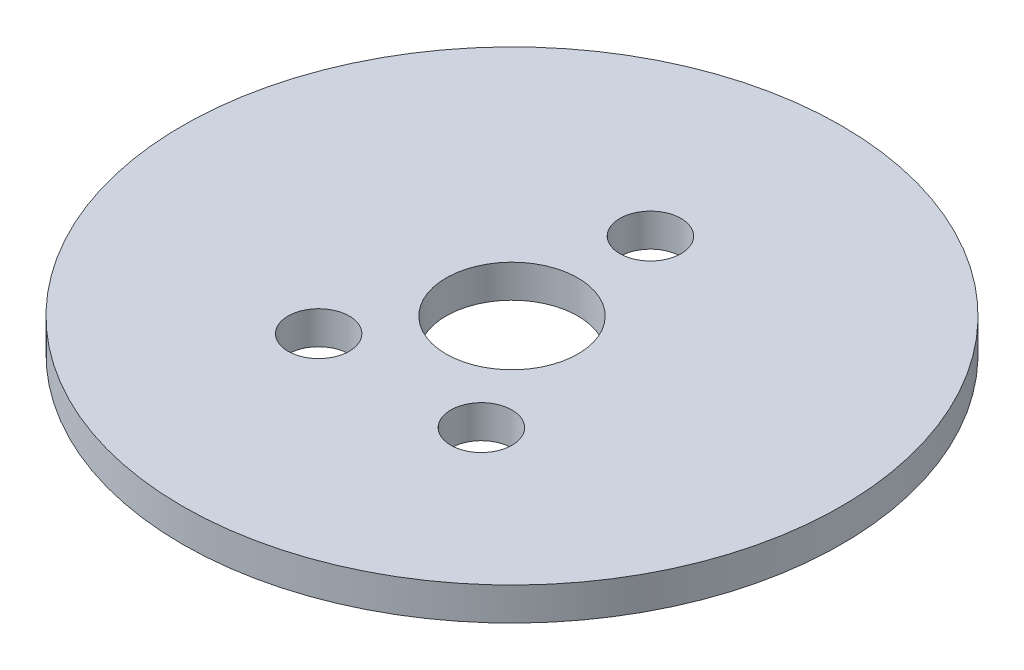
ISO-10303-21;
HEADER;
FILE_DESCRIPTION(('STEP AP214'),'2;1');
FILE_NAME('part.step','',(''),(''),'','','');
FILE_SCHEMA(('AUTOMOTIVE_DESIGN { 1 0 10303 214 1 1 1 1 }'));
ENDSEC;
DATA;
#1=APPLICATION_CONTEXT('core data for automotive mechanical design processes');
#2=APPLICATION_PROTOCOL_DEFINITION('international standard','automotive_design',2000,#1);
#3=PRODUCT_CONTEXT('',#1,'mechanical');
#4=PRODUCT('Part','Part','',(#3));
#5=PRODUCT_RELATED_PRODUCT_CATEGORY('part','',(#4));
#6=PRODUCT_DEFINITION_FORMATION('','',#4);
#7=PRODUCT_DEFINITION_CONTEXT('part definition',#1,'design');
#8=PRODUCT_DEFINITION('design','',#6,#7);
#9=PRODUCT_DEFINITION_SHAPE('','',#8);
#10=(LENGTH_UNIT() NAMED_UNIT(*) SI_UNIT(.MILLI.,.METRE.));
#11=(NAMED_UNIT(*) PLANE_ANGLE_UNIT() SI_UNIT($,.RADIAN.));
#12=(NAMED_UNIT(*) SI_UNIT($,.STERADIAN.) SOLID_ANGLE_UNIT());
#13=UNCERTAINTY_MEASURE_WITH_UNIT(LENGTH_MEASURE(1.E-05),#10,'distance_accuracy_value','');
#14=(GEOMETRIC_REPRESENTATION_CONTEXT(3) GLOBAL_UNCERTAINTY_ASSIGNED_CONTEXT((#13)) GLOBAL_UNIT_ASSIGNED_CONTEXT((#10,
#11,#12)) REPRESENTATION_CONTEXT('',''));
#15=CARTESIAN_POINT('',(0.,0.,0.));
#16=DIRECTION('',(0.,0.,1.));
#17=DIRECTION('',(1.,0.,0.));
#18=AXIS2_PLACEMENT_3D('',#15,#16,#17);
#19=CARTESIAN_POINT('',(0.562155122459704,1.5875,11.5195944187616));
#20=DIRECTION('',(0.,1.,0.));
#21=DIRECTION('',(0.,0.,1.));
#22=AXIS2_PLACEMENT_3D('',#19,#20,#21);
#23=PLANE('',#22);
#24=CARTESIAN_POINT('',(4.48121329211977,1.5875,16.9137152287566));
#25=DIRECTION('',(0.,1.,0.));
#26=DIRECTION('',(0.,0.,1.));
#27=AXIS2_PLACEMENT_3D('',#24,#25,#26);
#28=CIRCLE('',#27,1.4732);
#29=CARTESIAN_POINT('',(4.48121329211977,1.5875,18.3869152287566));
#30=VERTEX_POINT('',#29);
#31=EDGE_CURVE('E54',#30,#30,#28,.T.);
#32=ORIENTED_EDGE('',*,*,#31,.F.);
#33=EDGE_LOOP('',(#32));
#34=FACE_BOUND('',#33,.T.);
#35=CARTESIAN_POINT('',(0.562155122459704,1.5875,11.5195944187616));
#36=DIRECTION('',(0.,1.,0.));
#37=DIRECTION('',(0.,0.,1.));
#38=AXIS2_PLACEMENT_3D('',#35,#36,#37);
#39=CIRCLE('',#38,3.175);
#40=CARTESIAN_POINT('',(0.562155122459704,1.5875,14.6945944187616));
#41=VERTEX_POINT('',#40);
#42=EDGE_CURVE('E43',#41,#41,#39,.T.);
#43=ORIENTED_EDGE('',*,*,#42,.F.);
#44=EDGE_LOOP('',(#43));
#45=FACE_BOUND('',#44,.T.);
#46=CARTESIAN_POINT('',(0.562155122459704,1.5875,11.5195944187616));
#47=DIRECTION('',(0.,1.,0.));
#48=DIRECTION('',(0.,0.,1.));
#49=AXIS2_PLACEMENT_3D('',#46,#47,#48);
#50=CIRCLE('',#49,15.875);
#51=CARTESIAN_POINT('',(0.562155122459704,1.5875,27.3945944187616));
#52=VERTEX_POINT('',#51);
#53=EDGE_CURVE('E10',#52,#52,#50,.T.);
#54=ORIENTED_EDGE('',*,*,#53,.T.);
#55=EDGE_LOOP('',(#54));
#56=FACE_BOUND('',#55,.T.);
#57=CARTESIAN_POINT('',(0.562155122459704,1.5875,4.85209441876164));
#58=DIRECTION('',(0.,1.,0.));
#59=DIRECTION('',(0.,0.,1.));
#60=AXIS2_PLACEMENT_3D('',#57,#58,#59);
#61=CIRCLE('',#60,1.4732);
#62=CARTESIAN_POINT('',(0.562155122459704,1.5875,6.32529441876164));
#63=VERTEX_POINT('',#62);
#64=EDGE_CURVE('E48',#63,#63,#61,.T.);
#65=ORIENTED_EDGE('',*,*,#64,.F.);
#66=EDGE_LOOP('',(#65));
#67=FACE_BOUND('',#66,.T.);
#68=CARTESIAN_POINT('',(-3.35690304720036,1.5875,16.9137152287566));
#69=DIRECTION('',(0.,1.,0.));
#70=DIRECTION('',(0.,0.,1.));
#71=AXIS2_PLACEMENT_3D('',#68,#69,#70);
#72=CIRCLE('',#71,1.4732);
#73=CARTESIAN_POINT('',(-3.35690304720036,1.5875,18.3869152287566));
#74=VERTEX_POINT('',#73);
#75=EDGE_CURVE('E60',#74,#74,#72,.T.);
#76=ORIENTED_EDGE('',*,*,#75,.F.);
#77=EDGE_LOOP('',(#76));
#78=FACE_BOUND('',#77,.T.);
#79=ADVANCED_FACE('F32',(#34,#45,#56,#67,#78),#23,.T.);
#80=CARTESIAN_POINT('',(0.562155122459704,0.,11.5195944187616));
#81=DIRECTION('',(0.,1.,0.));
#82=DIRECTION('',(0.,0.,1.));
#83=AXIS2_PLACEMENT_3D('',#80,#81,#82);
#84=PLANE('',#83);
#85=CARTESIAN_POINT('',(0.562155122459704,0.,11.5195944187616));
#86=DIRECTION('',(0.,1.,0.));
#87=DIRECTION('',(0.,0.,1.));
#88=AXIS2_PLACEMENT_3D('',#85,#86,#87);
#89=CIRCLE('',#88,15.875);
#90=CARTESIAN_POINT('',(0.562155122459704,0.,27.3945944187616));
#91=VERTEX_POINT('',#90);
#92=EDGE_CURVE('E36',#91,#91,#89,.T.);
#93=ORIENTED_EDGE('',*,*,#92,.F.);
#94=EDGE_LOOP('',(#93));
#95=FACE_BOUND('',#94,.T.);
#96=CARTESIAN_POINT('',(0.562155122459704,0.,11.5195944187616));
#97=DIRECTION('',(0.,1.,0.));
#98=DIRECTION('',(0.,0.,1.));
#99=AXIS2_PLACEMENT_3D('',#96,#97,#98);
#100=CIRCLE('',#99,3.175);
#101=CARTESIAN_POINT('',(0.562155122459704,0.,14.6945944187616));
#102=VERTEX_POINT('',#101);
#103=EDGE_CURVE('E45',#102,#102,#100,.T.);
#104=ORIENTED_EDGE('',*,*,#103,.T.);
#105=EDGE_LOOP('',(#104));
#106=FACE_BOUND('',#105,.T.);
#107=CARTESIAN_POINT('',(0.562155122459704,0.,4.85209441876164));
#108=DIRECTION('',(0.,1.,0.));
#109=DIRECTION('',(0.,0.,1.));
#110=AXIS2_PLACEMENT_3D('',#107,#108,#109);
#111=CIRCLE('',#110,1.4732);
#112=CARTESIAN_POINT('',(0.562155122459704,0.,6.32529441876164));
#113=VERTEX_POINT('',#112);
#114=EDGE_CURVE('E51',#113,#113,#111,.T.);
#115=ORIENTED_EDGE('',*,*,#114,.T.);
#116=EDGE_LOOP('',(#115));
#117=FACE_BOUND('',#116,.T.);
#118=CARTESIAN_POINT('',(4.48121329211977,0.,16.9137152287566));
#119=DIRECTION('',(0.,1.,0.));
#120=DIRECTION('',(0.,0.,1.));
#121=AXIS2_PLACEMENT_3D('',#118,#119,#120);
#122=CIRCLE('',#121,1.4732);
#123=CARTESIAN_POINT('',(4.48121329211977,0.,18.3869152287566));
#124=VERTEX_POINT('',#123);
#125=EDGE_CURVE('E57',#124,#124,#122,.T.);
#126=ORIENTED_EDGE('',*,*,#125,.T.);
#127=EDGE_LOOP('',(#126));
#128=FACE_BOUND('',#127,.T.);
#129=CARTESIAN_POINT('',(-3.35690304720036,0.,16.9137152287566));
#130=DIRECTION('',(0.,1.,0.));
#131=DIRECTION('',(0.,0.,1.));
#132=AXIS2_PLACEMENT_3D('',#129,#130,#131);
#133=CIRCLE('',#132,1.4732);
#134=CARTESIAN_POINT('',(-3.35690304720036,0.,18.3869152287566));
#135=VERTEX_POINT('',#134);
#136=EDGE_CURVE('E63',#135,#135,#133,.T.);
#137=ORIENTED_EDGE('',*,*,#136,.T.);
#138=EDGE_LOOP('',(#137));
#139=FACE_BOUND('',#138,.T.);
#140=ADVANCED_FACE('F73',(#95,#106,#117,#128,#139),#84,.F.);
#141=CARTESIAN_POINT('',(0.562155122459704,1.5875,11.5195944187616));
#142=DIRECTION('',(0.,-1.,0.));
#143=DIRECTION('',(0.,0.,-1.));
#144=AXIS2_PLACEMENT_3D('',#141,#142,#143);
#145=CYLINDRICAL_SURFACE('',#144,15.875);
#146=ORIENTED_EDGE('',*,*,#53,.F.);
#147=EDGE_LOOP('',(#146));
#148=FACE_BOUND('',#147,.T.);
#149=ORIENTED_EDGE('',*,*,#92,.T.);
#150=EDGE_LOOP('',(#149));
#151=FACE_BOUND('',#150,.T.);
#152=ADVANCED_FACE('F34',(#148,#151),#145,.T.);
#153=CARTESIAN_POINT('',(0.562155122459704,1.5875,11.5195944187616));
#154=DIRECTION('',(0.,-1.,0.));
#155=DIRECTION('',(0.,0.,-1.));
#156=AXIS2_PLACEMENT_3D('',#153,#154,#155);
#157=CYLINDRICAL_SURFACE('',#156,3.175);
#158=ORIENTED_EDGE('',*,*,#42,.T.);
#159=EDGE_LOOP('',(#158));
#160=FACE_BOUND('',#159,.T.);
#161=ORIENTED_EDGE('',*,*,#103,.F.);
#162=EDGE_LOOP('',(#161));
#163=FACE_BOUND('',#162,.T.);
#164=ADVANCED_FACE('F83',(#160,#163),#157,.F.);
#165=CARTESIAN_POINT('',(0.562155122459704,1.5875,4.85209441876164));
#166=DIRECTION('',(0.,-1.,0.));
#167=DIRECTION('',(0.,0.,-1.));
#168=AXIS2_PLACEMENT_3D('',#165,#166,#167);
#169=CYLINDRICAL_SURFACE('',#168,1.4732);
#170=ORIENTED_EDGE('',*,*,#64,.T.);
#171=EDGE_LOOP('',(#170));
#172=FACE_BOUND('',#171,.T.);
#173=ORIENTED_EDGE('',*,*,#114,.F.);
#174=EDGE_LOOP('',(#173));
#175=FACE_BOUND('',#174,.T.);
#176=ADVANCED_FACE('F86',(#172,#175),#169,.F.);
#177=CARTESIAN_POINT('',(4.48121329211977,1.5875,16.9137152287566));
#178=DIRECTION('',(0.,-1.,0.));
#179=DIRECTION('',(0.,0.,-1.));
#180=AXIS2_PLACEMENT_3D('',#177,#178,#179);
#181=CYLINDRICAL_SURFACE('',#180,1.4732);
#182=ORIENTED_EDGE('',*,*,#31,.T.);
#183=EDGE_LOOP('',(#182));
#184=FACE_BOUND('',#183,.T.);
#185=ORIENTED_EDGE('',*,*,#125,.F.);
#186=EDGE_LOOP('',(#185));
#187=FACE_BOUND('',#186,.T.);
#188=ADVANCED_FACE('F90',(#184,#187),#181,.F.);
#189=CARTESIAN_POINT('',(-3.35690304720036,1.5875,16.9137152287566));
#190=DIRECTION('',(0.,-1.,0.));
#191=DIRECTION('',(0.,0.,-1.));
#192=AXIS2_PLACEMENT_3D('',#189,#190,#191);
#193=CYLINDRICAL_SURFACE('',#192,1.4732);
#194=ORIENTED_EDGE('',*,*,#75,.T.);
#195=EDGE_LOOP('',(#194));
#196=FACE_BOUND('',#195,.T.);
#197=ORIENTED_EDGE('',*,*,#136,.F.);
#198=EDGE_LOOP('',(#197));
#199=FACE_BOUND('',#198,.T.);
#200=ADVANCED_FACE('F69',(#196,#199),#193,.F.);
#201=CLOSED_SHELL('',(#79,#140,#152,#164,#176,#188,#200));
#202=MANIFOLD_SOLID_BREP('B2',#201);
#203=ADVANCED_BREP_SHAPE_REPRESENTATION('',(#18,#202),#14);
#204=SHAPE_DEFINITION_REPRESENTATION(#9,#203);
ENDSEC;
END-ISO-10303-21;
